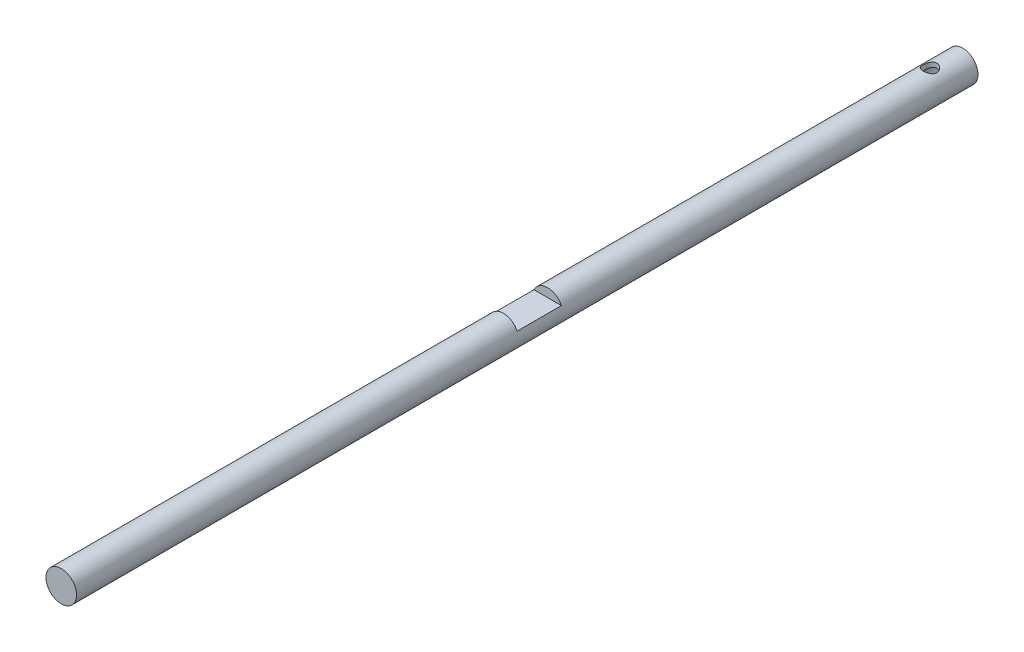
from build123d import *

# Parameters (mm, degrees)
SKETCH1_R           = 4.445
BOSS_EXTRUDE1_DEPTH = 262.049
SKETCH2_R           = 3.175
CUT_EXTRUDE1_DEPTH  = 25.4
SKETCH3_W           = 12.875
SKETCH3_H           = 8.89
CUT_EXTRUDE2_DEPTH  = 19.05


with BuildPart() as part:
    # Sketch1 → Boss-Extrude1 (new body)
    with BuildSketch(Plane.XY):
        Circle(SKETCH1_R)
    extrude(amount=-BOSS_EXTRUDE1_DEPTH)

    # Sketch2 → Cut-Extrude1 (cut)
    with BuildSketch(Plane(origin=(0, 0, -262.049), x_dir=(-1, 0, 0), z_dir=(0, 0, -1))):
        Circle(SKETCH2_R)
    extrude(amount=-CUT_EXTRUDE1_DEPTH, mode=Mode.SUBTRACT)

    # Sketch3 → Cut-Extrude2 (cut)
    with BuildSketch(Plane.ZX.offset(21)):
        with BuildLine():
            ThreePointArc((-250.524, 0), (-252.524, 2), (-254.524, 0))
            Line((-254.524, 0), (-250.524, 0))
        make_face()
        with BuildLine():
            Line((-250.524, 0), (-254.524, 0))
            ThreePointArc((-254.524, 0), (-252.524, -2), (-250.524, 0))
        make_face()
        with BuildLine():
            ThreePointArc((-250.524, 0), (-252.524, 2), (-254.524, 0))
            Line((-254.524, 0), (-250.524, 0))
        make_face()
        with BuildLine():
            Line((-250.524, 0), (-254.524, 0))
            ThreePointArc((-254.524, 0), (-252.524, -2), (-250.524, 0))
        make_face()
        with Locations((-134.9615, 0)):
            Rectangle(SKETCH3_W, SKETCH3_H)
    extrude(amount=-CUT_EXTRUDE2_DEPTH, mode=Mode.SUBTRACT)


solid = part.part
